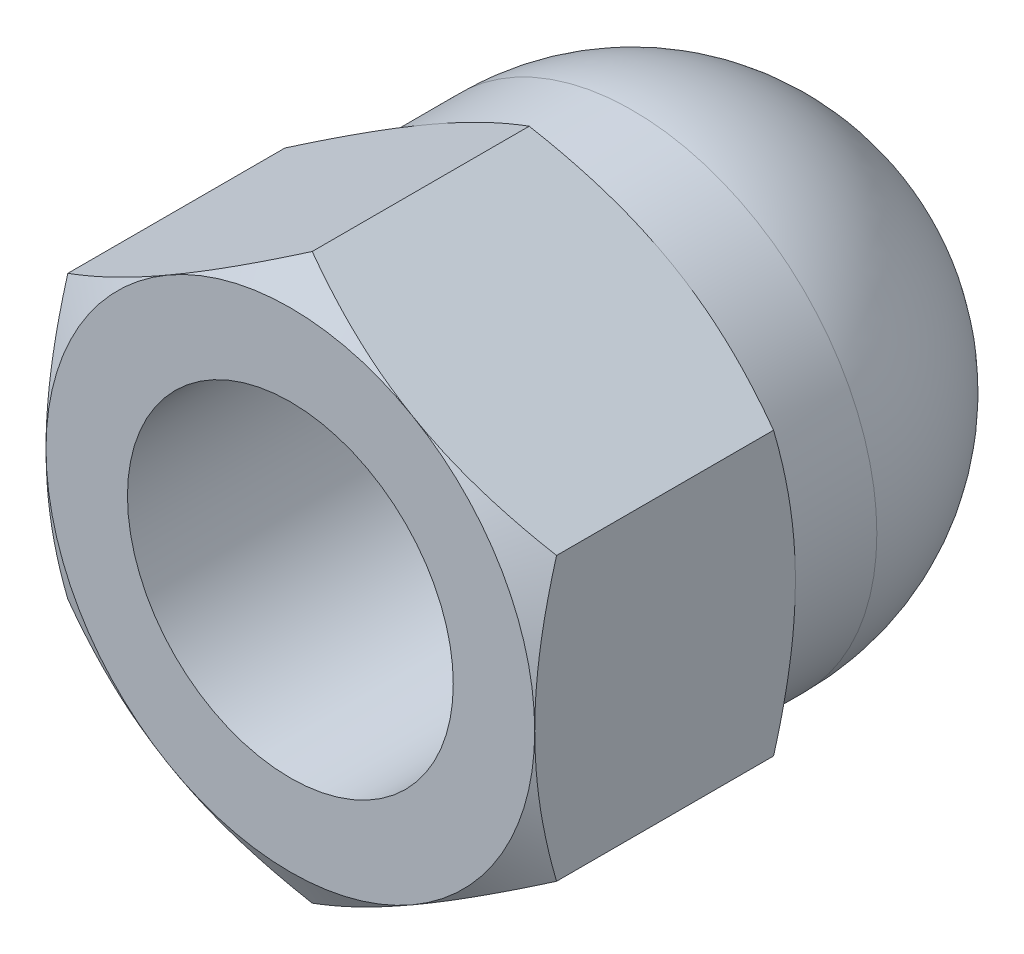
from build123d import *

# Parameters (mm, degrees)
BASE_EXTRUSION_DEPTH    = 16
ESQUISSE3_R             = 10
ENL_V_MAT_EXTRU_1_DEPTH = 16


with BuildPart() as part:
    # Esquisse1 → Base-Extrusion (new body)
    with BuildSketch(Plane.XY):
        Polygon((15, -8.660254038), (15, 8.660254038), (0, 17.320508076), (-15, 8.660254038), (-15, -8.660254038), (0, -17.320508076), align=None)
    extrude(amount=-BASE_EXTRUSION_DEPTH)

    # Esquisse2 → Enl_vement de mati_re-R_volution1 (revolve, cut)
    with BuildSketch(Plane(origin=(0, 0, 0), x_dir=(1, 0, 0), z_dir=(0, 1, 0))):
        Polygon((-15, 0), (-29.856406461, 0), (-29.856406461, 16), (-15, 16), (-28.856406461, 8), align=None)
    revolve(axis=Axis((0, 0, -16), (0, 0, 1)), mode=Mode.SUBTRACT)

    # Esquisse4 → Boss.-R_vol.1 (revolve)
    with BuildSketch(Plane(origin=(0, 0, 0), x_dir=(1, 0, 0), z_dir=(0, 1, 0)), mode=Mode.PRIVATE) as boss_r_vol_1_sk:
        with BuildLine():
            Line((-15, 21), (-15, 16))
            Line((-15, 16), (0, 16))
            Line((0, 16), (0, 36))
            ThreePointArc((0, 36), (-10.606601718, 31.606601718), (-15, 21))
        make_face()
    revolve(boss_r_vol_1_sk.sketch.rotate(Axis((0, 0, 0), (0, 0, -1)), 180), axis=Axis((0, 0, 0), (0, 0, -1)))

    # Esquisse3 → Enl_v. mat.-Extru.1 (cut)
    with BuildSketch(Plane.XY):
        Circle(ESQUISSE3_R)
    extrude(amount=-ENL_V_MAT_EXTRU_1_DEPTH, mode=Mode.SUBTRACT)


solid = part.part
